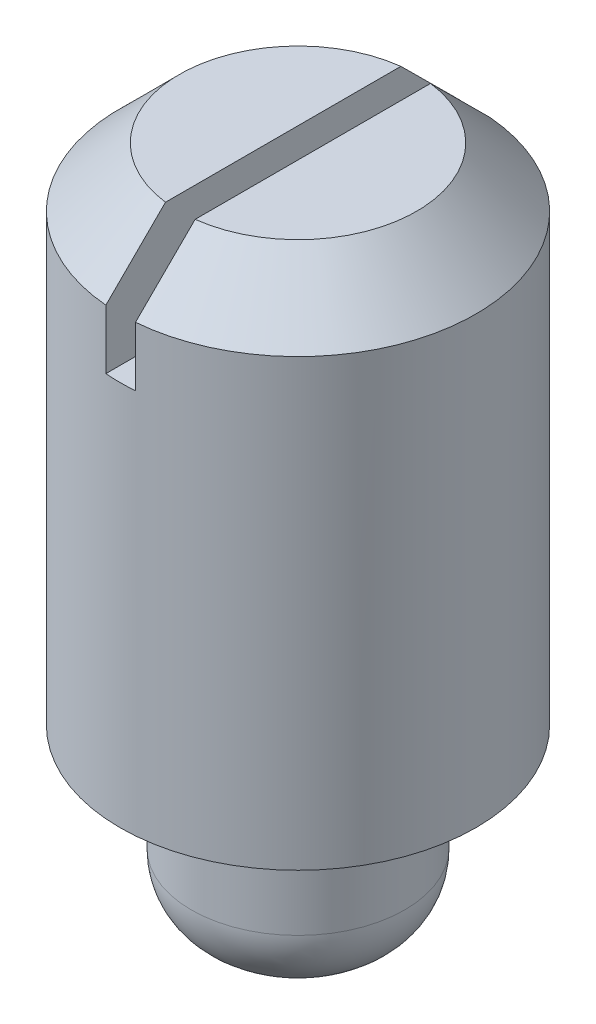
from build123d import *

# Parameters (mm, degrees)
SKETCH_1_R           = 3
EXTRUDE_1_DEPTH      = 8.5
EXTRUDE_2_DEPTH      = 3
EXTRUDE_2_DEPTH_BACK = 3
SKETCH_2_R           = 1.8
CHAMFER_1_SIZE       = 1
FILLET_1_R           = 0.5
FILLET_2_R           = 1.2
SKETCH_3_W           = 0.5
SKETCH_3_H           = 6.260432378
CUT_EXTRUDE_1_DEPTH  = 2


with BuildPart() as part:
    # Sketch 1 → Extrude 1 (new body)
    with BuildSketch(Plane(origin=(0, 0, 0), x_dir=(1, 0, 0), z_dir=(0, 1, 0))):
        with Locations(Location((0, 0, 0), (0, 0, 270))):
            Circle(SKETCH_1_R)
    extrude(amount=EXTRUDE_1_DEPTH)

    # Sketch 2 → Extrude 2 (add, two sides: drawn at the far end of the back side and taken through both)
    with BuildSketch(Plane(origin=(0, 0, 0), x_dir=(1, 0, 0), z_dir=(0, 1, 0)).offset(-EXTRUDE_2_DEPTH_BACK)):
        with Locations(Location((0, 0, 0), (0, 0, 270))):
            Circle(SKETCH_2_R)
    extrude(amount=EXTRUDE_2_DEPTH + EXTRUDE_2_DEPTH_BACK)

    # Chamfer 1
    chamfer_1_edges = [part.edges().sort_by_distance(p)[0] for p in [
        (0, 8.5, -3),
    ]]
    chamfer(chamfer_1_edges, length=CHAMFER_1_SIZE)

    # Fillet 1
    fillet_1_edges = [part.edges().sort_by_distance(p)[0] for p in [
        (0, 0, -1.8),
    ]]
    fillet(fillet_1_edges, radius=FILLET_1_R)

    # Fillet 2
    fillet_2_edges = [part.edges().sort_by_distance(p)[0] for p in [
        (0, -3, -1.8),
    ]]
    fillet(fillet_2_edges, radius=FILLET_2_R)

    # Sketch 3 → Cut-Extrude 1 (cut)
    with BuildSketch(Plane(origin=(0, 8.5, 0), x_dir=(-1, 0, 0), z_dir=(0, 1, 0))):
        with Locations((0, 0.011060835)):
            Rectangle(SKETCH_3_W, SKETCH_3_H)
    extrude(amount=-CUT_EXTRUDE_1_DEPTH, mode=Mode.SUBTRACT)


solid = part.part
